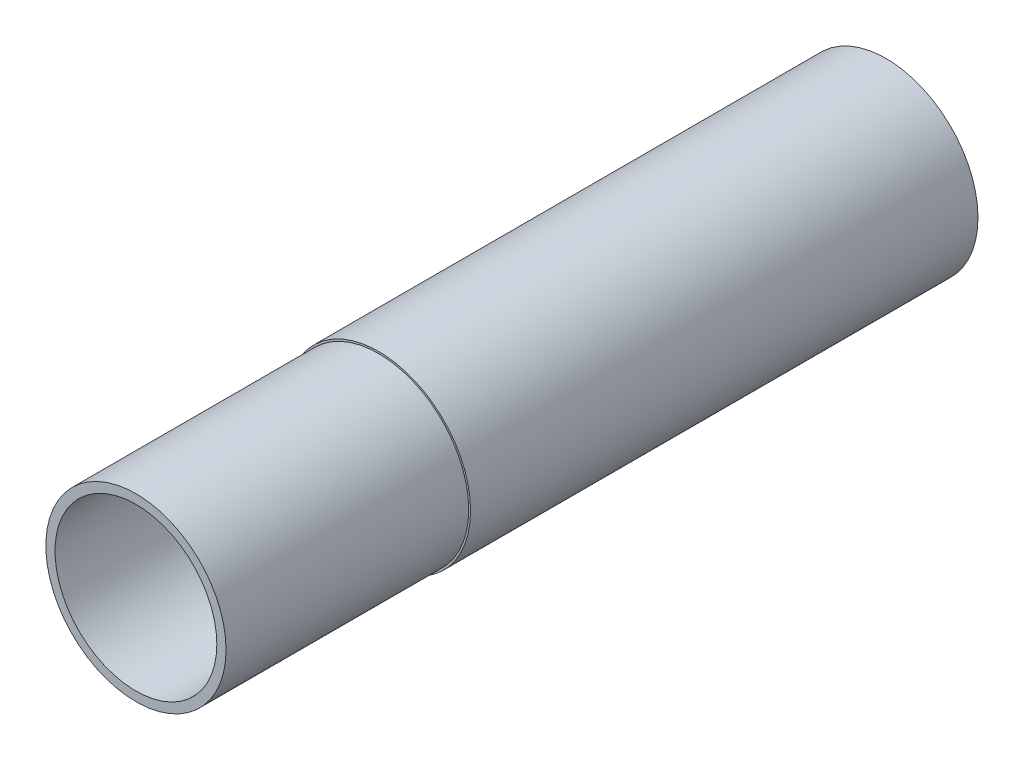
ISO-10303-21;
HEADER;
FILE_DESCRIPTION(('STEP AP214'),'2;1');
FILE_NAME('part.step','',(''),(''),'','','');
FILE_SCHEMA(('AUTOMOTIVE_DESIGN { 1 0 10303 214 1 1 1 1 }'));
ENDSEC;
DATA;
#1=APPLICATION_CONTEXT('core data for automotive mechanical design processes');
#2=APPLICATION_PROTOCOL_DEFINITION('international standard','automotive_design',2000,#1);
#3=PRODUCT_CONTEXT('',#1,'mechanical');
#4=PRODUCT('Part','Part','',(#3));
#5=PRODUCT_RELATED_PRODUCT_CATEGORY('part','',(#4));
#6=PRODUCT_DEFINITION_FORMATION('','',#4);
#7=PRODUCT_DEFINITION_CONTEXT('part definition',#1,'design');
#8=PRODUCT_DEFINITION('design','',#6,#7);
#9=PRODUCT_DEFINITION_SHAPE('','',#8);
#10=(LENGTH_UNIT() NAMED_UNIT(*) SI_UNIT(.MILLI.,.METRE.));
#11=(NAMED_UNIT(*) PLANE_ANGLE_UNIT() SI_UNIT($,.RADIAN.));
#12=(NAMED_UNIT(*) SI_UNIT($,.STERADIAN.) SOLID_ANGLE_UNIT());
#13=UNCERTAINTY_MEASURE_WITH_UNIT(LENGTH_MEASURE(1.E-05),#10,'distance_accuracy_value','');
#14=(GEOMETRIC_REPRESENTATION_CONTEXT(3) GLOBAL_UNCERTAINTY_ASSIGNED_CONTEXT((#13)) GLOBAL_UNIT_ASSIGNED_CONTEXT((#10,
#11,#12)) REPRESENTATION_CONTEXT('',''));
#15=CARTESIAN_POINT('',(0.,0.,0.));
#16=DIRECTION('',(0.,0.,1.));
#17=DIRECTION('',(1.,0.,0.));
#18=AXIS2_PLACEMENT_3D('',#15,#16,#17);
#19=CARTESIAN_POINT('',(0.,0.,102.));
#20=DIRECTION('',(0.,0.,1.));
#21=DIRECTION('',(1.,0.,0.));
#22=AXIS2_PLACEMENT_3D('',#19,#20,#21);
#23=PLANE('',#22);
#24=CARTESIAN_POINT('',(0.,0.,102.));
#25=DIRECTION('',(0.,0.,1.));
#26=DIRECTION('',(1.,0.,0.));
#27=AXIS2_PLACEMENT_3D('',#24,#25,#26);
#28=CIRCLE('',#27,11.);
#29=CARTESIAN_POINT('',(11.,0.,102.));
#30=VERTEX_POINT('',#29);
#31=EDGE_CURVE('E50',#30,#30,#28,.T.);
#32=ORIENTED_EDGE('',*,*,#31,.F.);
#33=EDGE_LOOP('',(#32));
#34=FACE_BOUND('',#33,.T.);
#35=CARTESIAN_POINT('',(0.,0.,102.));
#36=DIRECTION('',(0.,0.,1.));
#37=DIRECTION('',(1.,0.,0.));
#38=AXIS2_PLACEMENT_3D('',#35,#36,#37);
#39=CIRCLE('',#38,12.25);
#40=CARTESIAN_POINT('',(12.25,0.,102.));
#41=VERTEX_POINT('',#40);
#42=EDGE_CURVE('E67',#41,#41,#39,.T.);
#43=ORIENTED_EDGE('',*,*,#42,.T.);
#44=EDGE_LOOP('',(#43));
#45=FACE_BOUND('',#44,.T.);
#46=ADVANCED_FACE('F42',(#34,#45),#23,.T.);
#47=CARTESIAN_POINT('',(0.,0.,102.));
#48=DIRECTION('',(0.,0.,-1.));
#49=DIRECTION('',(-1.,0.,0.));
#50=AXIS2_PLACEMENT_3D('',#47,#48,#49);
#51=CYLINDRICAL_SURFACE('',#50,12.5);
#52=CARTESIAN_POINT('',(0.,0.,0.));
#53=DIRECTION('',(0.,0.,1.));
#54=DIRECTION('',(1.,0.,0.));
#55=AXIS2_PLACEMENT_3D('',#52,#53,#54);
#56=CIRCLE('',#55,12.5);
#57=CARTESIAN_POINT('',(12.5,0.,0.));
#58=VERTEX_POINT('',#57);
#59=EDGE_CURVE('E10',#58,#58,#56,.T.);
#60=ORIENTED_EDGE('',*,*,#59,.T.);
#61=EDGE_LOOP('',(#60));
#62=FACE_BOUND('',#61,.T.);
#63=CARTESIAN_POINT('',(0.,0.,69.));
#64=DIRECTION('',(0.,0.,1.));
#65=DIRECTION('',(1.,0.,0.));
#66=AXIS2_PLACEMENT_3D('',#63,#64,#65);
#67=CIRCLE('',#66,12.5);
#68=CARTESIAN_POINT('',(12.5,0.,69.));
#69=VERTEX_POINT('',#68);
#70=EDGE_CURVE('E61',#69,#69,#67,.T.);
#71=ORIENTED_EDGE('',*,*,#70,.F.);
#72=EDGE_LOOP('',(#71));
#73=FACE_BOUND('',#72,.T.);
#74=ADVANCED_FACE('F44',(#62,#73),#51,.T.);
#75=CARTESIAN_POINT('',(0.,0.,0.));
#76=DIRECTION('',(0.,0.,1.));
#77=DIRECTION('',(1.,0.,0.));
#78=AXIS2_PLACEMENT_3D('',#75,#76,#77);
#79=PLANE('',#78);
#80=ORIENTED_EDGE('',*,*,#59,.F.);
#81=EDGE_LOOP('',(#80));
#82=FACE_BOUND('',#81,.T.);
#83=CARTESIAN_POINT('',(0.,0.,0.));
#84=DIRECTION('',(0.,0.,1.));
#85=DIRECTION('',(1.,0.,0.));
#86=AXIS2_PLACEMENT_3D('',#83,#84,#85);
#87=CIRCLE('',#86,11.);
#88=CARTESIAN_POINT('',(11.,0.,0.));
#89=VERTEX_POINT('',#88);
#90=EDGE_CURVE('E55',#89,#89,#87,.T.);
#91=ORIENTED_EDGE('',*,*,#90,.T.);
#92=EDGE_LOOP('',(#91));
#93=FACE_BOUND('',#92,.T.);
#94=ADVANCED_FACE('F86',(#82,#93),#79,.F.);
#95=CARTESIAN_POINT('',(0.,0.,102.));
#96=DIRECTION('',(0.,0.,-1.));
#97=DIRECTION('',(-1.,0.,0.));
#98=AXIS2_PLACEMENT_3D('',#95,#96,#97);
#99=CYLINDRICAL_SURFACE('',#98,11.);
#100=ORIENTED_EDGE('',*,*,#31,.T.);
#101=EDGE_LOOP('',(#100));
#102=FACE_BOUND('',#101,.T.);
#103=ORIENTED_EDGE('',*,*,#90,.F.);
#104=EDGE_LOOP('',(#103));
#105=FACE_BOUND('',#104,.T.);
#106=ADVANCED_FACE('F81',(#102,#105),#99,.F.);
#107=CARTESIAN_POINT('',(0.,0.,69.));
#108=DIRECTION('',(0.,0.,1.));
#109=DIRECTION('',(1.,0.,0.));
#110=AXIS2_PLACEMENT_3D('',#107,#108,#109);
#111=PLANE('',#110);
#112=CARTESIAN_POINT('',(0.,0.,69.));
#113=DIRECTION('',(0.,0.,1.));
#114=DIRECTION('',(1.,0.,0.));
#115=AXIS2_PLACEMENT_3D('',#112,#113,#114);
#116=CIRCLE('',#115,12.25);
#117=CARTESIAN_POINT('',(12.25,0.,69.));
#118=VERTEX_POINT('',#117);
#119=EDGE_CURVE('E66',#118,#118,#116,.T.);
#120=ORIENTED_EDGE('',*,*,#119,.F.);
#121=EDGE_LOOP('',(#120));
#122=FACE_BOUND('',#121,.T.);
#123=ORIENTED_EDGE('',*,*,#70,.T.);
#124=EDGE_LOOP('',(#123));
#125=FACE_BOUND('',#124,.T.);
#126=ADVANCED_FACE('F78',(#122,#125),#111,.T.);
#127=CARTESIAN_POINT('',(0.,0.,69.));
#128=DIRECTION('',(0.,0.,1.));
#129=DIRECTION('',(1.,0.,0.));
#130=AXIS2_PLACEMENT_3D('',#127,#128,#129);
#131=CYLINDRICAL_SURFACE('',#130,12.25);
#132=ORIENTED_EDGE('',*,*,#119,.T.);
#133=EDGE_LOOP('',(#132));
#134=FACE_BOUND('',#133,.T.);
#135=ORIENTED_EDGE('',*,*,#42,.F.);
#136=EDGE_LOOP('',(#135));
#137=FACE_BOUND('',#136,.T.);
#138=ADVANCED_FACE('F75',(#134,#137),#131,.T.);
#139=CLOSED_SHELL('',(#46,#74,#94,#106,#126,#138));
#140=MANIFOLD_SOLID_BREP('B2',#139);
#141=ADVANCED_BREP_SHAPE_REPRESENTATION('',(#18,#140),#14);
#142=SHAPE_DEFINITION_REPRESENTATION(#9,#141);
ENDSEC;
END-ISO-10303-21;
